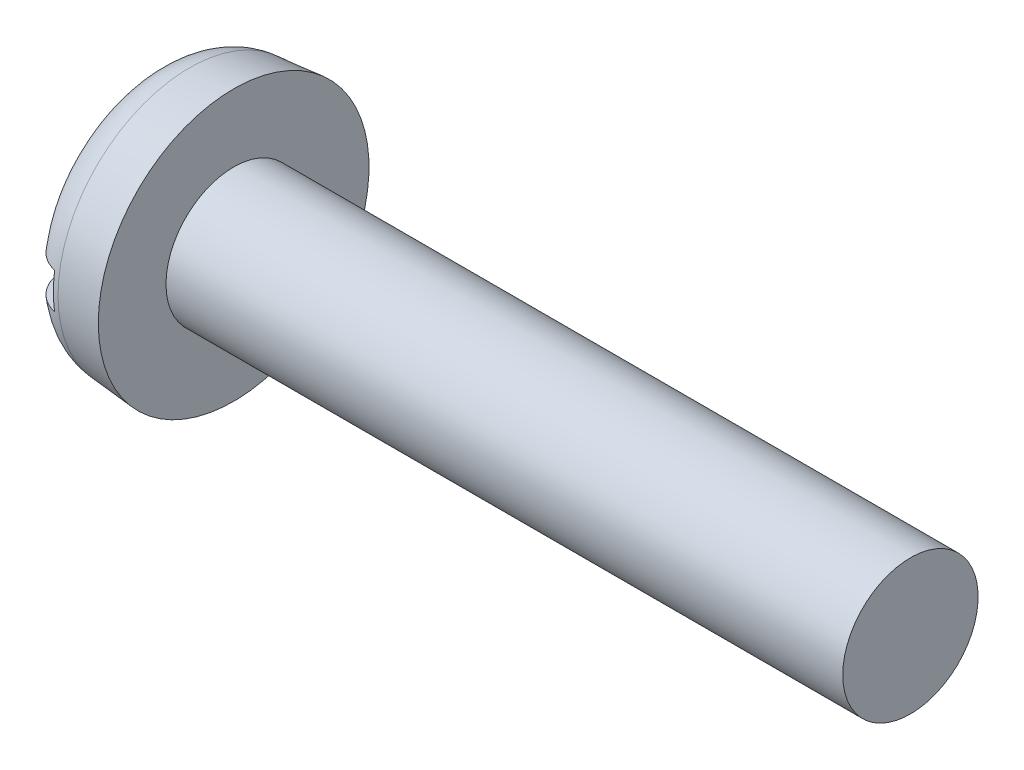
from build123d import *

# Parameters (mm, degrees)
FILLET2_R  = 1.8
SKETCH2_W  = 12
SKETCH2_H  = 1.6
SLOT_DEPTH = 1.4


with BuildPart() as part:
    # BodySke → Base-Revolve (revolve)
    with BuildSketch(Plane.XY, mode=Mode.PRIVATE) as base_revolve_sk:
        Polygon((3.6, 3), (3.6, 6), (0, 5.685040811), (0, 0), (33.6, 0), (33.6, 3), align=None)
    revolve(base_revolve_sk.sketch.rotate(Axis((-25.4, 0, 0), (1, 0, 0)), 90), axis=Axis((-25.4, 0, 0), (1, 0, 0)))

    # Fillet2
    fillet2_edges = [part.edges().sort_by_distance(p)[0] for p in [
        (0, 0, -5.685040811),
    ]]
    fillet(fillet2_edges, radius=FILLET2_R)

    # Sketch2 → Slot (cut)
    with BuildSketch(Plane(origin=(0, 0, 0), x_dir=(0, 0, -1), z_dir=(1, 0, 0))):
        Rectangle(SKETCH2_W, SKETCH2_H)
    extrude(amount=SLOT_DEPTH, mode=Mode.SUBTRACT)


solid = part.part
